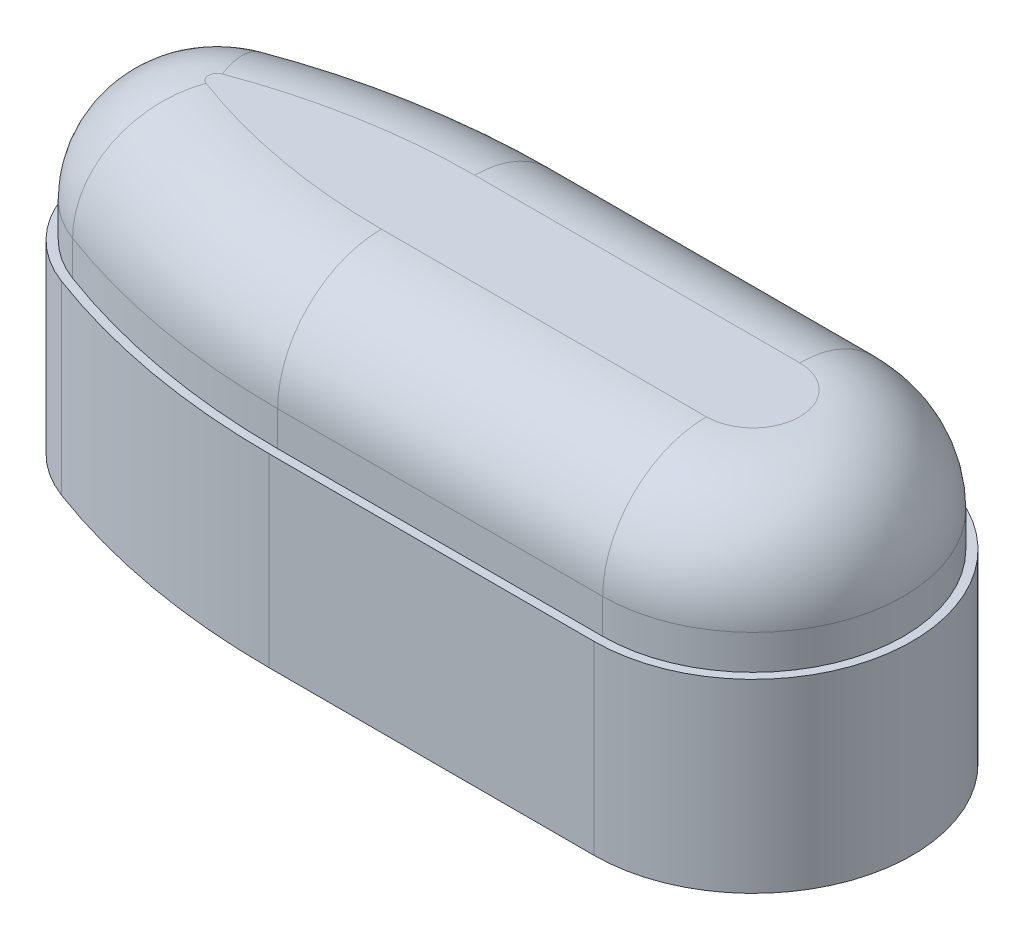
from build123d import *

# Parameters (mm, degrees)
BOSS_EXTRU_1_DEPTH = 18.72
COQUE1_T           = -2


with BuildPart() as part:
    # Esquisse1 → Boss.-Extru.1 (new body)
    with BuildSketch(Plane(origin=(0, 0, 0), x_dir=(1, 0, 0), z_dir=(0, 1, 0))):
        with BuildLine():
            Line((0, 9.2), (-18.8, 9.2))
            ThreePointArc((-18.8, 9.2), (-26.240645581, 8.534489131), (-33.445080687, 6.559083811))
            ThreePointArc((-33.445080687, 6.559083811), (-38, 0), (-33.445080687, -6.559083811))
            ThreePointArc((-33.445080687, -6.559083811), (-26.240645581, -8.534489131), (-18.8, -9.2))
            Line((-18.8, -9.2), (0, -9.2))
            ThreePointArc((0, -9.2), (9.2, 0), (0, 9.2))
        make_face()
    extrude(amount=BOSS_EXTRU_1_DEPTH)

    # Enl_vement de mati_re-Balayage5: sweep along a path in Esquisse3
    with BuildLine(Plane(origin=(0, 18.72, 0), x_dir=(1, 0, 0), z_dir=(0, 1, 0))) as enl_vement_de_mati_re_balayage5_path:
        Line((0, 9.2), (-18.8, 9.2))
        ThreePointArc((-18.8, 9.2), (-26.240645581, 8.534489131), (-33.445080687, 6.559083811))
        ThreePointArc((-33.445080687, 6.559083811), (-38, 0), (-33.445080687, -6.559083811))
        ThreePointArc((-33.445080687, -6.559083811), (-26.240645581, -8.534489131), (-18.8, -9.2))
        Line((-18.8, -9.2), (0, -9.2))
        ThreePointArc((0, -9.2), (9.2, 0), (0, 9.2))
    # Esquisse2 → Enl_vement de mati_re-Balayage5 (sweep, cut)
    with BuildSketch(Plane(origin=(0, 0, 0), x_dir=(0, 0, -1), z_dir=(1, 0, 0))):
        with BuildLine():
            Line((10.2, 10.72), (8.7, 10.72))
            Line((8.7, 10.72), (8.7, 12.72))
            ThreePointArc((8.7, 12.72), (6.942640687, 16.962640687), (2.7, 18.72))
            Line((2.7, 18.72), (2.7, 19.72))
            Line((2.7, 19.72), (10.2, 19.72))
            Line((10.2, 19.72), (10.2, 10.72))
        make_face()
    sweep(path=enl_vement_de_mati_re_balayage5_path.line, mode=Mode.SUBTRACT)

    # Coque1
    coque1_openings = [part.faces().sort_by_distance(p)[0] for p in [
        (-13.764320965, 0, 0),
    ]]
    offset(amount=COQUE1_T, openings=coque1_openings, kind=Kind.INTERSECTION)


solid = part.part
